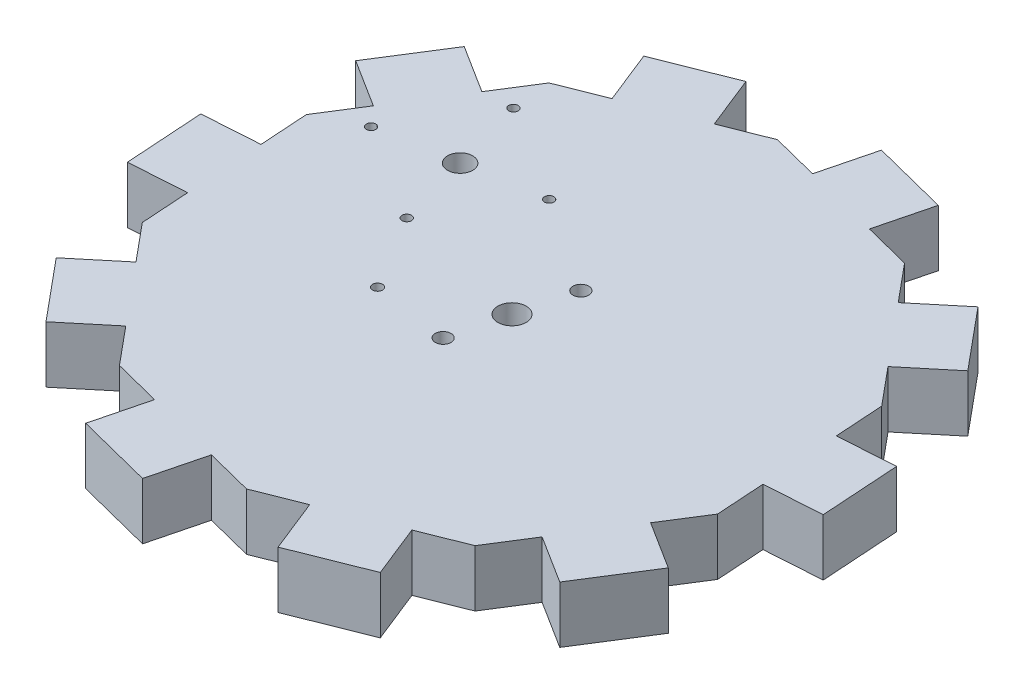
from build123d import *

# Parameters (mm, degrees)
BOSS_EXTRUDE1_DEPTH     = 18
SKETCH2_R               = 2.5
SKETCH2_R_2             = 4.5
CUT_EXTRUDE1_DEPTH      = 152.253716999
SKETCH3_R               = 11
CUT_EXTRUDE2_DEPTH      = 12
CUT_EXTRUDE3_DEPTH      = 10
FILLET1_R               = 2
SKETCH5_R               = 4
CUT_EXTRUDE4_DEPTH      = 151.657515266
SKETCH6_R               = 1.5
CUT_EXTRUDE5_DEPTH      = 151.511417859
CUT_EXTRUDE6_DEPTH      = 152.253716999
CUT_EXTRUDE6_DEPTH_BACK = 152.253716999
SKETCH7_R               = 1.6
SKETCH8_R               = 3
CUT_EXTRUDE7_DEPTH      = 10
BOSS_EXTRUDE2_DEPTH     = 18


with BuildPart() as part:
    # Sketch1 → Boss-Extrude1 (new body)
    with BuildSketch(Plane(origin=(0, 0, 0), x_dir=(1, 0, 0), z_dir=(0, 1, 0))):
        Polygon((-27.521528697, 77.447277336), (26.632818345, 63.685977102), (62.365259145, 20.698287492), (66.005017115, -35.069249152), (36.170307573, -82.325530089), (-15.730168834, -103.023530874), (-69.905850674, -89.248761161), (-105.629812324, -46.271272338), (-109.269570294, 9.496264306), (-79.434860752, 56.752545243), align=None)
    extrude(amount=BOSS_EXTRUDE1_DEPTH)

    # Sketch2 → Cut-Extrude1 (cut, through all)
    with BuildSketch(Plane(origin=(0, 18, 0), x_dir=(1, 0, 0), z_dir=(0, 1, 0))):
        with Locations(Location((-17.19670801, 4.658441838, 0), (0, 0, 270))):
            Circle(SKETCH2_R)
        with Locations(Location((-21.632276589, -12.786492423, 0), (0, 0, 270))):
            Circle(SKETCH2_R_2)
        with Locations(Location((-26.067845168, -30.231426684, 0), (0, 0, 270))):
            Circle(SKETCH2_R)
    extrude(amount=-CUT_EXTRUDE1_DEPTH, mode=Mode.SUBTRACT)

    # Sketch3 → Cut-Extrude2 (cut)
    with BuildSketch(Plane.XZ):
        with Locations(Location((-71.494531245, -20.586484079, 0), (0, 0, 270))):
            Circle(SKETCH3_R)
    extrude(amount=-CUT_EXTRUDE2_DEPTH, mode=Mode.SUBTRACT)

    # Sketch4 → Cut-Extrude3 (cut)
    with BuildSketch(Plane.XZ):
        Polygon((-64.948137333, 8.38151079), (-100.462526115, -14.040090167), (-78.040925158, -49.554478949), (-42.526536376, -27.132877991), align=None)
    extrude(amount=-CUT_EXTRUDE3_DEPTH, mode=Mode.SUBTRACT)

    # Fillet1
    fillet1_edges = [part.edges().sort_by_distance(p)[0] for p in [
        (-64.948137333, 5, 8.38151079),
        (-42.526536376, 5, -27.132877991),
        (-78.040925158, 5, -49.554478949),
        (-100.462526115, 5, -14.040090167),
    ]]
    fillet(fillet1_edges, radius=FILLET1_R)

    # Sketch5 → Cut-Extrude4 (cut, through all)
    with BuildSketch(Plane.XZ.offset(-12)):
        with Locations(Location((-71.494531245, -20.586484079, 0), (0, 0, 270))):
            Circle(SKETCH5_R)
    extrude(amount=-CUT_EXTRUDE4_DEPTH, mode=Mode.SUBTRACT)

    # Sketch6 → Cut-Extrude5 (cut, through all)
    with BuildSketch(Plane.XZ.offset(-10)):
        with Locations(Location((-47.349861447, -24.737980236, 0), (0, 0, 270))):
            Circle(SKETCH6_R)
        with Locations(Location((-78.128998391, -44.170034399, 0), (0, 0, 90))):
            Circle(SKETCH6_R)
        with Locations(Location((-95.639201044, -16.434987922, 0), (0, 0, 270))):
            Circle(SKETCH6_R)
        with Locations(Location((-64.8600641, 2.997066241, 0), (0, 0, 90))):
            Circle(SKETCH6_R)
    extrude(amount=-CUT_EXTRUDE5_DEPTH, mode=Mode.SUBTRACT)

    # Sketch7 → Cut-Extrude6 (cut, two sides: drawn at the far end of the back side and taken through both)
    with BuildSketch(Plane.XZ.offset(-CUT_EXTRUDE6_DEPTH_BACK)):
        with Locations(Location((-50.458451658, 26.680794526, 0), (0, 0, 270))):
            Circle(SKETCH7_R)
    extrude(amount=CUT_EXTRUDE6_DEPTH + CUT_EXTRUDE6_DEPTH_BACK, mode=Mode.SUBTRACT)

    # Sketch8 → Cut-Extrude7 (cut)
    with BuildSketch(Plane.XZ):
        with Locations(Location((-50.458451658, 26.680794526, 0), (0, 0, 270))):
            Circle(SKETCH8_R)
    extrude(amount=-CUT_EXTRUDE7_DEPTH, mode=Mode.SUBTRACT)

    # Sketch9 → Boss-Extrude2 (add)
    with BuildSketch(Plane(origin=(0, 18, 0), x_dir=(1, 0, 0), z_dir=(0, 1, 0))):
        Polygon((-101.025311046, 22.554646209), (-87.67912, 43.694163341), (-102.899572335, 53.303420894), (-116.245763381, 32.163903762), align=None)
        Polygon((-65.089590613, 62.471144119), (-41.866798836, 71.72867846), (-48.532223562, 88.44908854), (-71.755015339, 79.191554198), align=None)
        Polygon((-12.554653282, 73.641782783), (11.67442208, 67.481270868), (16.109990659, 84.926205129), (-8.119084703, 91.086717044), align=None)
        Polygon((36.512940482, 51.799757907), (52.493616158, 32.574305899), (66.335941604, 44.080392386), (50.355265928, 63.305844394), align=None)
        Polygon((63.371037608, 5.287980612), (64.999238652, -19.658942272), (82.961023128, -18.48663752), (81.332822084, 6.460285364), align=None)
        Polygon((57.760757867, -48.127631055), (44.414566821, -69.267148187), (59.635019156, -78.87640574), (72.981210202, -57.736888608), align=None)
        Polygon((21.825037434, -88.044128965), (-1.397754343, -97.301663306), (5.267670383, -114.022073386), (28.49046216, -104.764539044), align=None)
        Polygon((-30.709899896, -99.214767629), (-54.938975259, -93.054255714), (-59.374543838, -110.499189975), (-35.145468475, -116.65970189), align=None)
        Polygon((-79.777493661, -77.372742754), (-95.758169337, -58.147290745), (-109.600494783, -69.653377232), (-93.619819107, -88.87882924), align=None)
        Polygon((-106.635590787, -30.860965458), (-108.263791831, -5.914042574), (-126.225576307, -7.086347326), (-124.597375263, -32.03327021), align=None)
    extrude(amount=-BOSS_EXTRUDE2_DEPTH)


solid = part.part
